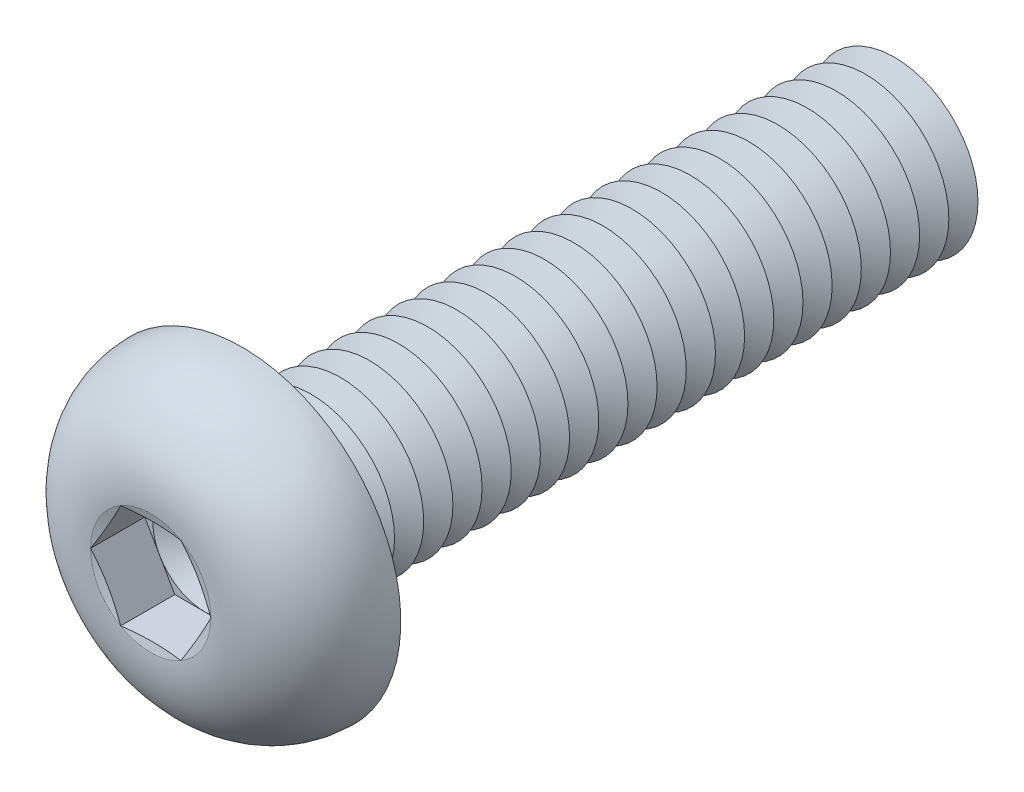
from build123d import *

# Parameters (mm, degrees)
FILLET1_R          = 0.35
LPATTERN1_COUNT    = 22
LPATTERN1_PITCH    = 0.7
CUT_EXTRUDE1_DEPTH = 1.3


with BuildPart() as part:
    # Sketch1 → Revolve1 (revolve)
    with BuildSketch(Plane(origin=(0, 0, 0), x_dir=(0, 0, -1), z_dir=(1, 0, 0)), mode=Mode.PRIVATE) as revolve1_sk:
        with BuildLine():
            Line((0, 2), (0, 3.8))
            ThreePointArc((0, 3.8), (-1.611961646, 3.099623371), (-2.2, 1.443375))
            Line((-2.2, 1.443375), (-2.006624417, 0.7216875))
            Line((-2.006624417, 0.7216875), (-2.2, 0.7216875))
            Line((-2.2, 0.7216875), (-2.2, 0))
            Line((-2.2, 0), (16, 0))
            Line((16, 0), (16, 2))
            Line((16, 2), (0, 2))
        make_face()
    revolve(revolve1_sk.sketch.rotate(Axis((0, 0, -16), (0, 0, 1)), 90), axis=Axis((0, 0, -16), (0, 0, 1)))

    # Fillet1
    fillet1_edges = [part.edges().sort_by_distance(p)[0] for p in [
        (2, 0, 0),
    ]]
    fillet(fillet1_edges, radius=FILLET1_R)

    # Sketch2 → Cut-Revolve1 (revolve, cut)
    with BuildSketch(Plane(origin=(0, 0, 0), x_dir=(0, 0, -1), z_dir=(1, 0, 0)), mode=Mode.PRIVATE) as cut_revolve1_sk:
        Polygon((15.65, 2), (16.35, 2), (16, 1.393782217), align=None)
    cut_revolve1 = revolve(cut_revolve1_sk.sketch.rotate(Axis((0, 0, -16), (0, 0, -1)), 270), axis=Axis((0, 0, -16), (0, 0, -1)), mode=Mode.SUBTRACT)

    # LPattern1: Cut-Revolve1 ×22
    with Locations(*[(0, 0, i * LPATTERN1_PITCH) for i in range(1, LPATTERN1_COUNT)]):
        add(cut_revolve1, mode=Mode.SUBTRACT)

    # Sketch3 → Cut-Extrude1 (cut)
    with BuildSketch(Plane.XY.offset(2.2)):
        Polygon((0.7216875, 1.249999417), (-0.7216875, 1.249999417), (-1.443375, 0), (-0.7216875, -1.249999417), (0.7216875, -1.249999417), (1.443375, 0), align=None)
    extrude(amount=-CUT_EXTRUDE1_DEPTH, mode=Mode.SUBTRACT)

    # Cut-Extrude2 cone 1 section (on through the dimple's axis) → Cut-Extrude2 (revolve, cut)
    with BuildSketch(Plane(origin=(0, 0, 0.9), x_dir=(0, -1, 0), z_dir=(1, 0, 0))):
        Polygon((0, 0), (1.249999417, 0), (0, 0.7216875), align=None)
    revolve(axis=Axis((0, 0, 0.9), (0, 0, -1)), mode=Mode.SUBTRACT)


solid = part.part
